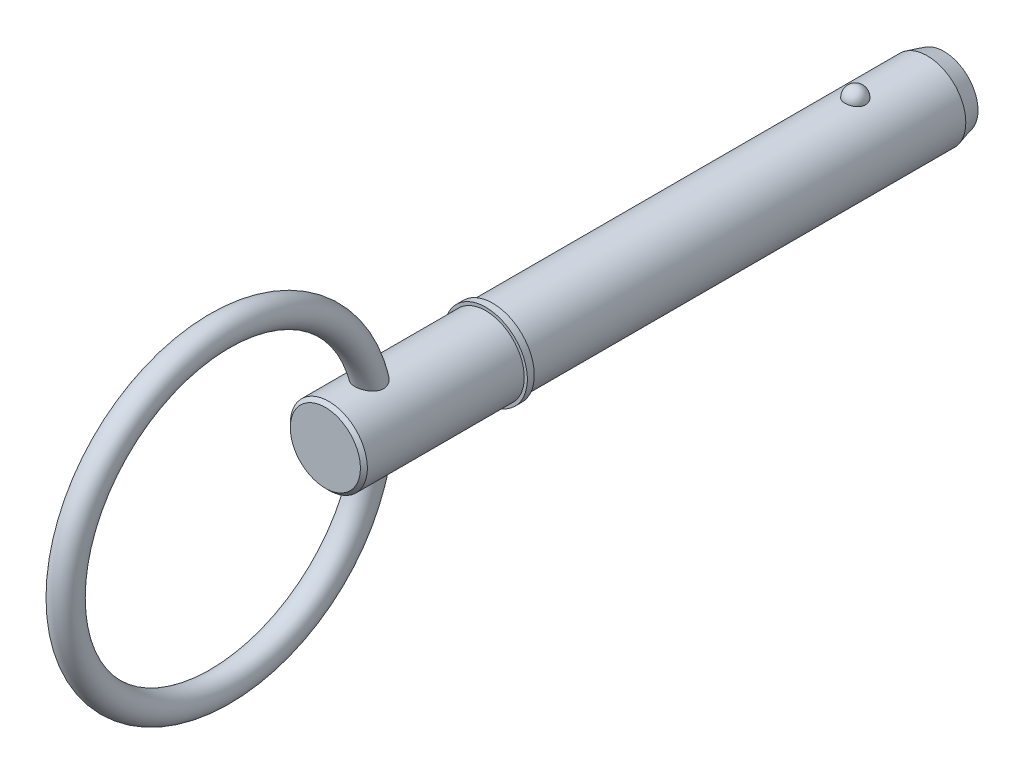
from build123d import *

# Parameters (mm, degrees)
SKETCH2_R           = 5.555
BOSS_EXTRUDE1_DEPTH = 50.8
BOSS_EXTRUDE2_START = 14.27
SKETCH3_R           = 5.555
BOSS_EXTRUDE2_DEPTH = 14.27
CHAMFER1_SIZE       = 2.4
CHAMFER1_SIZE2      = 0.643078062
SKETCH20_W          = 1
SKETCH20_H          = 6
SKETCH21_R          = 5.555
BOSS_EXTRUDE3_DEPTH = 24.13
CHAMFER2_SIZE       = 0.5
SKETCH24_R          = 2


with BuildPart() as part:
    # Sketch2 → Boss-Extrude1 (new body)
    with BuildSketch(Plane.XY):
        Circle(SKETCH2_R)
    extrude(amount=BOSS_EXTRUDE1_DEPTH)

    # Sketch3 → Boss-Extrude2 (add)
    with BuildSketch(Plane(origin=(0, 0, 0), x_dir=(-1, 0, 0), z_dir=(0, 0, -1)).offset(BOSS_EXTRUDE2_START)):
        Circle(SKETCH3_R)
    extrude(amount=-BOSS_EXTRUDE2_DEPTH)

    # Chamfer1
    chamfer1_edges = [part.edges().sort_by_distance(p)[0] for p in [
        (5.555, 0, -14.27),
    ]]
    chamfer1_side = [part.faces().sort_by_distance(p)[0] for p in [
        (5.555, 0, -7.135),
    ]]
    chamfer(chamfer1_edges, length=CHAMFER1_SIZE, length2=CHAMFER1_SIZE2, reference=chamfer1_side[0])

    # Sketch18 → Revolve1 (revolve)
    with BuildSketch(Plane(origin=(0, 0, 0), x_dir=(0, 0, -1), z_dir=(1, 0, 0))):
        with BuildLine():
            Line((1.49, 7.045), (1.49, 4.065))
            ThreePointArc((1.49, 4.065), (0, 5.555), (1.49, 7.045))
        make_face()
    revolve(axis=Axis((0, 7.045, -1.49), (0, -1, 0)))

    # Sketch20 → Revolve2 (revolve)
    with BuildSketch(Plane(origin=(0, 0, 0), x_dir=(0, 0, -1), z_dir=(1, 0, 0)), mode=Mode.PRIVATE) as revolve2_sk:
        with Locations((-51.3, 3)):
            Rectangle(SKETCH20_W, SKETCH20_H)
    revolve(revolve2_sk.sketch.rotate(Axis((0, 0, 33.728787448), (0, 0, 1)), 270), axis=Axis((0, 0, 33.728787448), (0, 0, 1)))

    # Sketch21 → Boss-Extrude3 (add)
    with BuildSketch(Plane(origin=(0, 0, 50.8), x_dir=(-1, 0, 0), z_dir=(0, 0, -1))):
        with Locations(Location((0, 0, 0), (0, 0, 180))):
            Circle(SKETCH21_R)
    extrude(amount=-BOSS_EXTRUDE3_DEPTH)

    # Chamfer2
    chamfer2_edges = [part.edges().sort_by_distance(p)[0] for p in [
        (-5.555, 0, 74.93),
    ]]
    chamfer(chamfer2_edges, length=CHAMFER2_SIZE)

    # Sweep1: sweep along a path in Sketch23
    with BuildLine(Plane(origin=(0, 0, 0), x_dir=(0, 0, -1), z_dir=(1, 0, 0))) as sweep1_path:
        CenterArc((-90.155, 0), 22.225, 0, 360)
    # Sketch24 → Sweep1 (sweep)
    with BuildSketch(Plane(origin=(0, 0, 0), x_dir=(1, 0, 0), z_dir=(0, 1, 0))):
        with Locations((0, -67.93)):
            Circle(SKETCH24_R)
    sweep(path=sweep1_path.line)


solid = part.part
